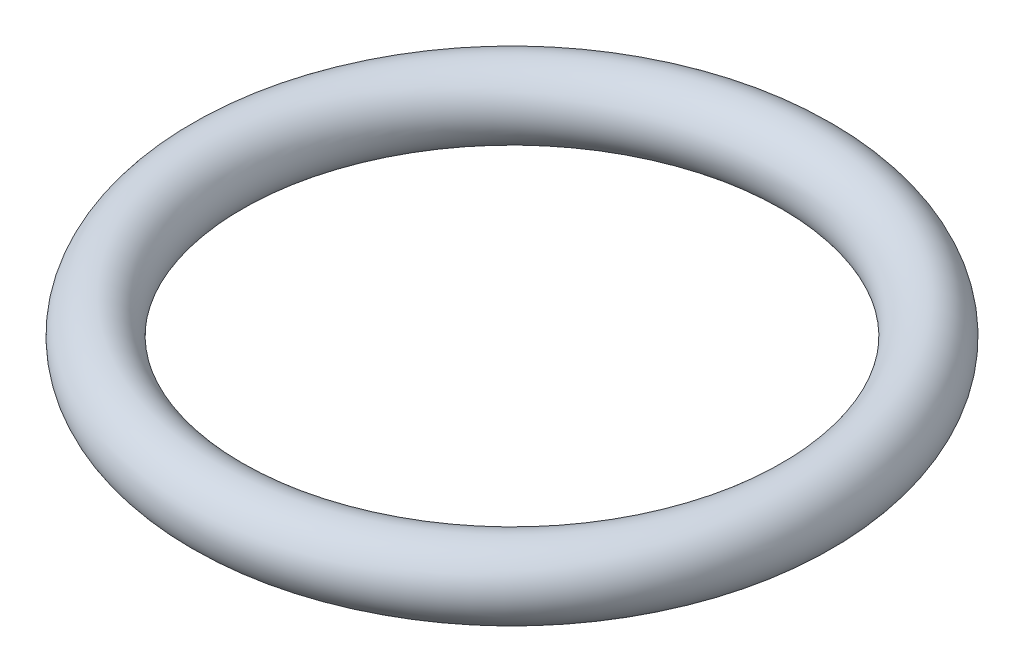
from build123d import *

# Parameters (mm, degrees)
ESQUISSE1_R = 1.75


with BuildPart() as part:
    # Esquisse1 → Base-R_volution (revolve)
    with BuildSketch(Plane.XY, mode=Mode.PRIVATE) as base_r_volution_sk:
        with Locations((14.7, 0)):
            Circle(ESQUISSE1_R)
    revolve(base_r_volution_sk.sketch.rotate(Axis((0, 0, 0), (0, 1, 0)), 90), axis=Axis((0, 0, 0), (0, 1, 0)))


solid = part.part
